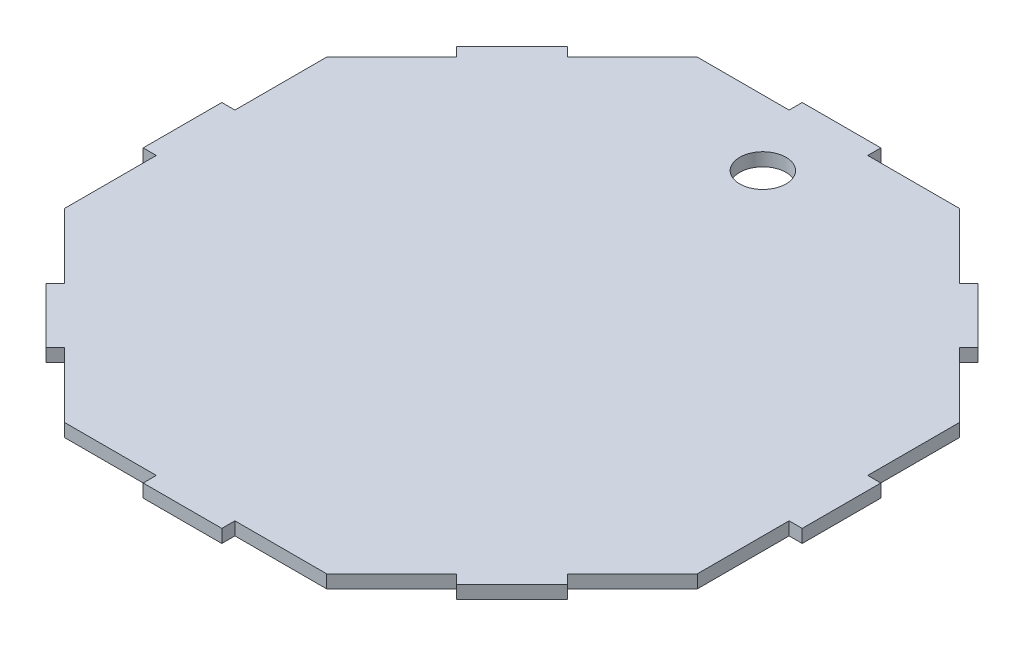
ISO-10303-21;
HEADER;
FILE_DESCRIPTION(('STEP AP214'),'2;1');
FILE_NAME('part.step','',(''),(''),'','','');
FILE_SCHEMA(('AUTOMOTIVE_DESIGN { 1 0 10303 214 1 1 1 1 }'));
ENDSEC;
DATA;
#1=APPLICATION_CONTEXT('core data for automotive mechanical design processes');
#2=APPLICATION_PROTOCOL_DEFINITION('international standard','automotive_design',2000,#1);
#3=PRODUCT_CONTEXT('',#1,'mechanical');
#4=PRODUCT('Part','Part','',(#3));
#5=PRODUCT_RELATED_PRODUCT_CATEGORY('part','',(#4));
#6=PRODUCT_DEFINITION_FORMATION('','',#4);
#7=PRODUCT_DEFINITION_CONTEXT('part definition',#1,'design');
#8=PRODUCT_DEFINITION('design','',#6,#7);
#9=PRODUCT_DEFINITION_SHAPE('','',#8);
#10=(LENGTH_UNIT() NAMED_UNIT(*) SI_UNIT(.MILLI.,.METRE.));
#11=(NAMED_UNIT(*) PLANE_ANGLE_UNIT() SI_UNIT($,.RADIAN.));
#12=(NAMED_UNIT(*) SI_UNIT($,.STERADIAN.) SOLID_ANGLE_UNIT());
#13=UNCERTAINTY_MEASURE_WITH_UNIT(LENGTH_MEASURE(1.E-05),#10,'distance_accuracy_value','');
#14=(GEOMETRIC_REPRESENTATION_CONTEXT(3) GLOBAL_UNCERTAINTY_ASSIGNED_CONTEXT((#13)) GLOBAL_UNIT_ASSIGNED_CONTEXT((#10,
#11,#12)) REPRESENTATION_CONTEXT('',''));
#15=CARTESIAN_POINT('',(0.,0.,0.));
#16=DIRECTION('',(0.,0.,1.));
#17=DIRECTION('',(1.,0.,0.));
#18=AXIS2_PLACEMENT_3D('',#15,#16,#17);
#19=CARTESIAN_POINT('',(104.801696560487,5.,8.72649424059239E-13));
#20=DIRECTION('',(1.,0.,0.));
#21=DIRECTION('',(0.,0.,-1.));
#22=AXIS2_PLACEMENT_3D('',#19,#20,#21);
#23=PLANE('',#22);
#24=DIRECTION('',(0.,0.,1.));
#25=VECTOR('',#24,1.);
#26=CARTESIAN_POINT('',(104.801696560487,0.,8.72649424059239E-13));
#27=LINE('',#26,#25);
#28=CARTESIAN_POINT('',(104.801696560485,0.,156.372402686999));
#29=VERTEX_POINT('',#28);
#30=CARTESIAN_POINT('',(104.801696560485,0.,161.372402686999));
#31=VERTEX_POINT('',#30);
#32=EDGE_CURVE('E326',#29,#31,#27,.T.);
#33=ORIENTED_EDGE('',*,*,#32,.F.);
#34=DIRECTION('',(0.,-1.,0.));
#35=VECTOR('',#34,1.);
#36=CARTESIAN_POINT('',(104.801696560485,5.,156.372402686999));
#37=LINE('',#36,#35);
#38=CARTESIAN_POINT('',(104.801696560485,5.,156.372402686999));
#39=VERTEX_POINT('',#38);
#40=EDGE_CURVE('E11',#39,#29,#37,.T.);
#41=ORIENTED_EDGE('',*,*,#40,.F.);
#42=DIRECTION('',(0.,0.,1.));
#43=VECTOR('',#42,1.);
#44=CARTESIAN_POINT('',(104.801696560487,5.,8.72649424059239E-13));
#45=LINE('',#44,#43);
#46=CARTESIAN_POINT('',(104.801696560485,5.,161.372402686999));
#47=VERTEX_POINT('',#46);
#48=EDGE_CURVE('E540',#39,#47,#45,.T.);
#49=ORIENTED_EDGE('',*,*,#48,.T.);
#50=DIRECTION('',(0.,-1.,0.));
#51=VECTOR('',#50,1.);
#52=CARTESIAN_POINT('',(104.801696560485,5.,161.372402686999));
#53=LINE('',#52,#51);
#54=EDGE_CURVE('E54',#47,#31,#53,.T.);
#55=ORIENTED_EDGE('',*,*,#54,.T.);
#56=EDGE_LOOP('',(#33,#41,#49,#55));
#57=FACE_BOUND('',#56,.T.);
#58=ADVANCED_FACE('F37',(#57),#23,.T.);
#59=CARTESIAN_POINT('',(7.44035322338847E-13,5.,156.372402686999));
#60=DIRECTION('',(0.,0.,1.));
#61=DIRECTION('',(1.,0.,0.));
#62=AXIS2_PLACEMENT_3D('',#59,#60,#61);
#63=PLANE('',#62);
#64=DIRECTION('',(-1.,0.,0.));
#65=VECTOR('',#64,1.);
#66=CARTESIAN_POINT('',(7.44035322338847E-13,0.,156.372402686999));
#67=LINE('',#66,#65);
#68=CARTESIAN_POINT('',(139.801696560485,0.,156.372402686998));
#69=VERTEX_POINT('',#68);
#70=EDGE_CURVE('E328',#69,#29,#67,.T.);
#71=ORIENTED_EDGE('',*,*,#70,.F.);
#72=DIRECTION('',(0.,-1.,0.));
#73=VECTOR('',#72,1.);
#74=CARTESIAN_POINT('',(139.801696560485,5.,156.372402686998));
#75=LINE('',#74,#73);
#76=CARTESIAN_POINT('',(139.801696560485,5.,156.372402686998));
#77=VERTEX_POINT('',#76);
#78=EDGE_CURVE('E46',#77,#69,#75,.T.);
#79=ORIENTED_EDGE('',*,*,#78,.F.);
#80=DIRECTION('',(-1.,0.,0.));
#81=VECTOR('',#80,1.);
#82=CARTESIAN_POINT('',(7.44035322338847E-13,5.,156.372402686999));
#83=LINE('',#82,#81);
#84=EDGE_CURVE('E538',#77,#39,#83,.T.);
#85=ORIENTED_EDGE('',*,*,#84,.T.);
#86=ORIENTED_EDGE('',*,*,#40,.T.);
#87=EDGE_LOOP('',(#71,#79,#85,#86));
#88=FACE_BOUND('',#87,.T.);
#89=ADVANCED_FACE('F523',(#88),#63,.T.);
#90=CARTESIAN_POINT('',(148.087049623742,5.,148.087049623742));
#91=DIRECTION('',(0.707106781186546,0.,0.707106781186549));
#92=DIRECTION('',(0.707106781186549,0.,-0.707106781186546));
#93=AXIS2_PLACEMENT_3D('',#90,#91,#92);
#94=PLANE('',#93);
#95=DIRECTION('',(-0.707106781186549,0.,0.707106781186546));
#96=VECTOR('',#95,1.);
#97=CARTESIAN_POINT('',(148.087049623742,0.,148.087049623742));
#98=LINE('',#97,#96);
#99=CARTESIAN_POINT('',(164.550433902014,0.,131.623665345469));
#100=VERTEX_POINT('',#99);
#101=EDGE_CURVE('E331',#100,#69,#98,.T.);
#102=ORIENTED_EDGE('',*,*,#101,.F.);
#103=DIRECTION('',(0.,-1.,0.));
#104=VECTOR('',#103,1.);
#105=CARTESIAN_POINT('',(164.550433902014,5.,131.623665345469));
#106=LINE('',#105,#104);
#107=CARTESIAN_POINT('',(164.550433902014,5.,131.623665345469));
#108=VERTEX_POINT('',#107);
#109=EDGE_CURVE('E512',#108,#100,#106,.T.);
#110=ORIENTED_EDGE('',*,*,#109,.F.);
#111=DIRECTION('',(-0.707106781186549,0.,0.707106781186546));
#112=VECTOR('',#111,1.);
#113=CARTESIAN_POINT('',(148.087049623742,5.,148.087049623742));
#114=LINE('',#113,#112);
#115=EDGE_CURVE('E519',#108,#77,#114,.T.);
#116=ORIENTED_EDGE('',*,*,#115,.T.);
#117=ORIENTED_EDGE('',*,*,#78,.T.);
#118=EDGE_LOOP('',(#102,#110,#116,#117));
#119=FACE_BOUND('',#118,.T.);
#120=ADVANCED_FACE('F517',(#119),#94,.T.);
#121=CARTESIAN_POINT('',(16.4633842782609,5.,-16.4633842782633));
#122=DIRECTION('',(0.707106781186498,0.,-0.707106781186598));
#123=DIRECTION('',(-0.707106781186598,0.,-0.707106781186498));
#124=AXIS2_PLACEMENT_3D('',#121,#122,#123);
#125=PLANE('',#124);
#126=DIRECTION('',(0.707106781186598,0.,0.707106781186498));
#127=VECTOR('',#126,1.);
#128=CARTESIAN_POINT('',(16.4633842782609,0.,-16.4633842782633));
#129=LINE('',#128,#127);
#130=CARTESIAN_POINT('',(168.085967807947,0.,135.159199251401));
#131=VERTEX_POINT('',#130);
#132=EDGE_CURVE('E334',#100,#131,#129,.T.);
#133=ORIENTED_EDGE('',*,*,#132,.T.);
#134=DIRECTION('',(0.,-1.,0.));
#135=VECTOR('',#134,1.);
#136=CARTESIAN_POINT('',(168.085967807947,5.,135.159199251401));
#137=LINE('',#136,#135);
#138=CARTESIAN_POINT('',(168.085967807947,5.,135.159199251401));
#139=VERTEX_POINT('',#138);
#140=EDGE_CURVE('E510',#139,#131,#137,.T.);
#141=ORIENTED_EDGE('',*,*,#140,.F.);
#142=DIRECTION('',(0.707106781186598,0.,0.707106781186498));
#143=VECTOR('',#142,1.);
#144=CARTESIAN_POINT('',(16.4633842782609,5.,-16.4633842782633));
#145=LINE('',#144,#143);
#146=EDGE_CURVE('E534',#108,#139,#145,.T.);
#147=ORIENTED_EDGE('',*,*,#146,.F.);
#148=ORIENTED_EDGE('',*,*,#109,.T.);
#149=EDGE_LOOP('',(#133,#141,#147,#148));
#150=FACE_BOUND('',#149,.T.);
#151=ADVANCED_FACE('F531',(#150),#125,.F.);
#152=CARTESIAN_POINT('',(151.622583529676,5.,151.622583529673));
#153=DIRECTION('',(0.707106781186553,0.,0.707106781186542));
#154=DIRECTION('',(0.707106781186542,0.,-0.707106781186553));
#155=AXIS2_PLACEMENT_3D('',#152,#153,#154);
#156=PLANE('',#155);
#157=DIRECTION('',(-0.707106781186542,0.,0.707106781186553));
#158=VECTOR('',#157,1.);
#159=CARTESIAN_POINT('',(151.622583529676,0.,151.622583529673));
#160=LINE('',#159,#158);
#161=CARTESIAN_POINT('',(189.299171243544,0.,113.945995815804));
#162=VERTEX_POINT('',#161);
#163=EDGE_CURVE('E337',#162,#131,#160,.T.);
#164=ORIENTED_EDGE('',*,*,#163,.F.);
#165=DIRECTION('',(0.,-1.,0.));
#166=VECTOR('',#165,1.);
#167=CARTESIAN_POINT('',(189.299171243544,5.,113.945995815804));
#168=LINE('',#167,#166);
#169=CARTESIAN_POINT('',(189.299171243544,5.,113.945995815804));
#170=VERTEX_POINT('',#169);
#171=EDGE_CURVE('E508',#170,#162,#168,.T.);
#172=ORIENTED_EDGE('',*,*,#171,.F.);
#173=DIRECTION('',(-0.707106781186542,0.,0.707106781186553));
#174=VECTOR('',#173,1.);
#175=CARTESIAN_POINT('',(151.622583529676,5.,151.622583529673));
#176=LINE('',#175,#174);
#177=EDGE_CURVE('E536',#170,#139,#176,.T.);
#178=ORIENTED_EDGE('',*,*,#177,.T.);
#179=ORIENTED_EDGE('',*,*,#140,.T.);
#180=EDGE_LOOP('',(#164,#172,#178,#179));
#181=FACE_BOUND('',#180,.T.);
#182=ADVANCED_FACE('F656',(#181),#156,.T.);
#183=CARTESIAN_POINT('',(37.676587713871,5.,-37.6765877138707));
#184=DIRECTION('',(-0.70710678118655,0.,0.707106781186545));
#185=DIRECTION('',(0.707106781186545,0.,0.70710678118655));
#186=AXIS2_PLACEMENT_3D('',#183,#184,#185);
#187=PLANE('',#186);
#188=DIRECTION('',(-0.707106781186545,0.,-0.70710678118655));
#189=VECTOR('',#188,1.);
#190=CARTESIAN_POINT('',(37.676587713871,0.,-37.6765877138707));
#191=LINE('',#190,#189);
#192=CARTESIAN_POINT('',(185.763637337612,0.,110.410461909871));
#193=VERTEX_POINT('',#192);
#194=EDGE_CURVE('E340',#162,#193,#191,.T.);
#195=ORIENTED_EDGE('',*,*,#194,.T.);
#196=DIRECTION('',(0.,-1.,0.));
#197=VECTOR('',#196,1.);
#198=CARTESIAN_POINT('',(185.763637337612,5.,110.410461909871));
#199=LINE('',#198,#197);
#200=CARTESIAN_POINT('',(185.763637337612,5.,110.410461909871));
#201=VERTEX_POINT('',#200);
#202=EDGE_CURVE('E506',#201,#193,#199,.T.);
#203=ORIENTED_EDGE('',*,*,#202,.F.);
#204=DIRECTION('',(-0.707106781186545,0.,-0.70710678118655));
#205=VECTOR('',#204,1.);
#206=CARTESIAN_POINT('',(37.676587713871,5.,-37.6765877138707));
#207=LINE('',#206,#205);
#208=EDGE_CURVE('E545',#170,#201,#207,.T.);
#209=ORIENTED_EDGE('',*,*,#208,.F.);
#210=ORIENTED_EDGE('',*,*,#171,.T.);
#211=EDGE_LOOP('',(#195,#203,#209,#210));
#212=FACE_BOUND('',#211,.T.);
#213=ADVANCED_FACE('F659',(#212),#187,.F.);
#214=CARTESIAN_POINT('',(148.087049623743,5.,148.087049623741));
#215=DIRECTION('',(0.707106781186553,0.,0.707106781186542));
#216=DIRECTION('',(0.707106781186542,0.,-0.707106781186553));
#217=AXIS2_PLACEMENT_3D('',#214,#215,#216);
#218=PLANE('',#217);
#219=DIRECTION('',(-0.707106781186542,0.,0.707106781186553));
#220=VECTOR('',#219,1.);
#221=CARTESIAN_POINT('',(148.087049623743,0.,148.087049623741));
#222=LINE('',#221,#220);
#223=CARTESIAN_POINT('',(210.51237467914,0.,85.6617245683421));
#224=VERTEX_POINT('',#223);
#225=EDGE_CURVE('E343',#224,#193,#222,.T.);
#226=ORIENTED_EDGE('',*,*,#225,.F.);
#227=DIRECTION('',(0.,-1.,0.));
#228=VECTOR('',#227,1.);
#229=CARTESIAN_POINT('',(210.51237467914,5.,85.6617245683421));
#230=LINE('',#229,#228);
#231=CARTESIAN_POINT('',(210.51237467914,5.,85.6617245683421));
#232=VERTEX_POINT('',#231);
#233=EDGE_CURVE('E504',#232,#224,#230,.T.);
#234=ORIENTED_EDGE('',*,*,#233,.F.);
#235=DIRECTION('',(-0.707106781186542,0.,0.707106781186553));
#236=VECTOR('',#235,1.);
#237=CARTESIAN_POINT('',(148.087049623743,5.,148.087049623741));
#238=LINE('',#237,#236);
#239=EDGE_CURVE('E547',#232,#201,#238,.T.);
#240=ORIENTED_EDGE('',*,*,#239,.T.);
#241=ORIENTED_EDGE('',*,*,#202,.T.);
#242=EDGE_LOOP('',(#226,#234,#240,#241));
#243=FACE_BOUND('',#242,.T.);
#244=ADVANCED_FACE('F663',(#243),#218,.T.);
#245=CARTESIAN_POINT('',(210.512374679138,5.,-7.01147056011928E-12));
#246=DIRECTION('',(1.,0.,0.));
#247=DIRECTION('',(0.,0.,-1.));
#248=AXIS2_PLACEMENT_3D('',#245,#246,#247);
#249=PLANE('',#248);
#250=DIRECTION('',(0.,0.,1.));
#251=VECTOR('',#250,1.);
#252=CARTESIAN_POINT('',(210.512374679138,0.,-7.01147056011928E-12));
#253=LINE('',#252,#251);
#254=CARTESIAN_POINT('',(210.512374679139,0.,50.661724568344));
#255=VERTEX_POINT('',#254);
#256=EDGE_CURVE('E346',#255,#224,#253,.T.);
#257=ORIENTED_EDGE('',*,*,#256,.F.);
#258=DIRECTION('',(0.,-1.,0.));
#259=VECTOR('',#258,1.);
#260=CARTESIAN_POINT('',(210.512374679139,5.,50.661724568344));
#261=LINE('',#260,#259);
#262=CARTESIAN_POINT('',(210.512374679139,5.,50.661724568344));
#263=VERTEX_POINT('',#262);
#264=EDGE_CURVE('E502',#263,#255,#261,.T.);
#265=ORIENTED_EDGE('',*,*,#264,.F.);
#266=DIRECTION('',(0.,0.,1.));
#267=VECTOR('',#266,1.);
#268=CARTESIAN_POINT('',(210.512374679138,5.,-7.01147056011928E-12));
#269=LINE('',#268,#267);
#270=EDGE_CURVE('E550',#263,#232,#269,.T.);
#271=ORIENTED_EDGE('',*,*,#270,.T.);
#272=ORIENTED_EDGE('',*,*,#233,.T.);
#273=EDGE_LOOP('',(#257,#265,#271,#272));
#274=FACE_BOUND('',#273,.T.);
#275=ADVANCED_FACE('F667',(#274),#249,.T.);
#276=CARTESIAN_POINT('',(2.10921799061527E-11,5.,50.6617245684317));
#277=DIRECTION('',(-4.16333634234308E-13,0.,-1.));
#278=DIRECTION('',(-1.,0.,4.16333634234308E-13));
#279=AXIS2_PLACEMENT_3D('',#276,#277,#278);
#280=PLANE('',#279);
#281=DIRECTION('',(1.,0.,-4.16333634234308E-13));
#282=VECTOR('',#281,1.);
#283=CARTESIAN_POINT('',(2.10921799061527E-11,0.,50.6617245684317));
#284=LINE('',#283,#282);
#285=CARTESIAN_POINT('',(215.512374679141,0.,50.6617245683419));
#286=VERTEX_POINT('',#285);
#287=EDGE_CURVE('E349',#255,#286,#284,.T.);
#288=ORIENTED_EDGE('',*,*,#287,.T.);
#289=DIRECTION('',(0.,-1.,0.));
#290=VECTOR('',#289,1.);
#291=CARTESIAN_POINT('',(215.512374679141,5.,50.6617245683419));
#292=LINE('',#291,#290);
#293=CARTESIAN_POINT('',(215.512374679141,5.,50.6617245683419));
#294=VERTEX_POINT('',#293);
#295=EDGE_CURVE('E500',#294,#286,#292,.T.);
#296=ORIENTED_EDGE('',*,*,#295,.F.);
#297=DIRECTION('',(1.,0.,-4.16333634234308E-13));
#298=VECTOR('',#297,1.);
#299=CARTESIAN_POINT('',(2.10921799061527E-11,5.,50.6617245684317));
#300=LINE('',#299,#298);
#301=EDGE_CURVE('E553',#263,#294,#300,.T.);
#302=ORIENTED_EDGE('',*,*,#301,.F.);
#303=ORIENTED_EDGE('',*,*,#264,.T.);
#304=EDGE_LOOP('',(#288,#296,#302,#303));
#305=FACE_BOUND('',#304,.T.);
#306=ADVANCED_FACE('F671',(#305),#280,.F.);
#307=CARTESIAN_POINT('',(215.512374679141,5.,2.19327900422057E-12));
#308=DIRECTION('',(1.,0.,0.));
#309=DIRECTION('',(0.,0.,-1.));
#310=AXIS2_PLACEMENT_3D('',#307,#308,#309);
#311=PLANE('',#310);
#312=DIRECTION('',(0.,0.,1.));
#313=VECTOR('',#312,1.);
#314=CARTESIAN_POINT('',(215.512374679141,0.,2.19327900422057E-12));
#315=LINE('',#314,#313);
#316=CARTESIAN_POINT('',(215.512374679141,0.,20.6617245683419));
#317=VERTEX_POINT('',#316);
#318=EDGE_CURVE('E352',#317,#286,#315,.T.);
#319=ORIENTED_EDGE('',*,*,#318,.F.);
#320=DIRECTION('',(0.,-1.,0.));
#321=VECTOR('',#320,1.);
#322=CARTESIAN_POINT('',(215.512374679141,5.,20.6617245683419));
#323=LINE('',#322,#321);
#324=CARTESIAN_POINT('',(215.512374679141,5.,20.6617245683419));
#325=VERTEX_POINT('',#324);
#326=EDGE_CURVE('E498',#325,#317,#323,.T.);
#327=ORIENTED_EDGE('',*,*,#326,.F.);
#328=DIRECTION('',(0.,0.,1.));
#329=VECTOR('',#328,1.);
#330=CARTESIAN_POINT('',(215.512374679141,5.,2.19327900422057E-12));
#331=LINE('',#330,#329);
#332=EDGE_CURVE('E555',#325,#294,#331,.T.);
#333=ORIENTED_EDGE('',*,*,#332,.T.);
#334=ORIENTED_EDGE('',*,*,#295,.T.);
#335=EDGE_LOOP('',(#319,#327,#333,#334));
#336=FACE_BOUND('',#335,.T.);
#337=ADVANCED_FACE('F675',(#336),#311,.T.);
#338=CARTESIAN_POINT('',(0.,5.,20.6617245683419));
#339=DIRECTION('',(0.,0.,-1.));
#340=DIRECTION('',(-1.,0.,0.));
#341=AXIS2_PLACEMENT_3D('',#338,#339,#340);
#342=PLANE('',#341);
#343=DIRECTION('',(1.,0.,0.));
#344=VECTOR('',#343,1.);
#345=CARTESIAN_POINT('',(0.,0.,20.6617245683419));
#346=LINE('',#345,#344);
#347=CARTESIAN_POINT('',(210.512374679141,0.,20.6617245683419));
#348=VERTEX_POINT('',#347);
#349=EDGE_CURVE('E355',#348,#317,#346,.T.);
#350=ORIENTED_EDGE('',*,*,#349,.F.);
#351=DIRECTION('',(0.,-1.,0.));
#352=VECTOR('',#351,1.);
#353=CARTESIAN_POINT('',(210.512374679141,5.,20.6617245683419));
#354=LINE('',#353,#352);
#355=CARTESIAN_POINT('',(210.512374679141,5.,20.6617245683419));
#356=VERTEX_POINT('',#355);
#357=EDGE_CURVE('E496',#356,#348,#354,.T.);
#358=ORIENTED_EDGE('',*,*,#357,.F.);
#359=DIRECTION('',(1.,0.,0.));
#360=VECTOR('',#359,1.);
#361=CARTESIAN_POINT('',(0.,5.,20.6617245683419));
#362=LINE('',#361,#360);
#363=EDGE_CURVE('E558',#356,#325,#362,.T.);
#364=ORIENTED_EDGE('',*,*,#363,.T.);
#365=ORIENTED_EDGE('',*,*,#326,.T.);
#366=EDGE_LOOP('',(#350,#358,#364,#365));
#367=FACE_BOUND('',#366,.T.);
#368=ADVANCED_FACE('F679',(#367),#342,.T.);
#369=CARTESIAN_POINT('',(210.512374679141,5.,2.00327730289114E-12));
#370=DIRECTION('',(1.,0.,0.));
#371=DIRECTION('',(0.,0.,-1.));
#372=AXIS2_PLACEMENT_3D('',#369,#370,#371);
#373=PLANE('',#372);
#374=DIRECTION('',(0.,0.,1.));
#375=VECTOR('',#374,1.);
#376=CARTESIAN_POINT('',(210.512374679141,0.,2.00327730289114E-12));
#377=LINE('',#376,#375);
#378=CARTESIAN_POINT('',(210.512374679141,0.,-14.3382754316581));
#379=VERTEX_POINT('',#378);
#380=EDGE_CURVE('E358',#379,#348,#377,.T.);
#381=ORIENTED_EDGE('',*,*,#380,.F.);
#382=DIRECTION('',(0.,-1.,0.));
#383=VECTOR('',#382,1.);
#384=CARTESIAN_POINT('',(210.512374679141,5.,-14.3382754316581));
#385=LINE('',#384,#383);
#386=CARTESIAN_POINT('',(210.512374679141,5.,-14.3382754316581));
#387=VERTEX_POINT('',#386);
#388=EDGE_CURVE('E494',#387,#379,#385,.T.);
#389=ORIENTED_EDGE('',*,*,#388,.F.);
#390=DIRECTION('',(0.,0.,1.));
#391=VECTOR('',#390,1.);
#392=CARTESIAN_POINT('',(210.512374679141,5.,2.00327730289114E-12));
#393=LINE('',#392,#391);
#394=EDGE_CURVE('E561',#387,#356,#393,.T.);
#395=ORIENTED_EDGE('',*,*,#394,.T.);
#396=ORIENTED_EDGE('',*,*,#357,.T.);
#397=EDGE_LOOP('',(#381,#389,#395,#396));
#398=FACE_BOUND('',#397,.T.);
#399=ADVANCED_FACE('F683',(#398),#373,.T.);
#400=CARTESIAN_POINT('',(112.425325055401,5.,-112.4253250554));
#401=DIRECTION('',(0.707106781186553,0.,-0.707106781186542));
#402=DIRECTION('',(-0.707106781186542,0.,-0.707106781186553));
#403=AXIS2_PLACEMENT_3D('',#400,#401,#402);
#404=PLANE('',#403);
#405=DIRECTION('',(0.707106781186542,0.,0.707106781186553));
#406=VECTOR('',#405,1.);
#407=CARTESIAN_POINT('',(112.425325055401,0.,-112.4253250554));
#408=LINE('',#407,#406);
#409=CARTESIAN_POINT('',(185.763637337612,0.,-39.0870127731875));
#410=VERTEX_POINT('',#409);
#411=EDGE_CURVE('E361',#410,#379,#408,.T.);
#412=ORIENTED_EDGE('',*,*,#411,.F.);
#413=DIRECTION('',(0.,-1.,0.));
#414=VECTOR('',#413,1.);
#415=CARTESIAN_POINT('',(185.763637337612,5.,-39.0870127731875));
#416=LINE('',#415,#414);
#417=CARTESIAN_POINT('',(185.763637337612,5.,-39.0870127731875));
#418=VERTEX_POINT('',#417);
#419=EDGE_CURVE('E492',#418,#410,#416,.T.);
#420=ORIENTED_EDGE('',*,*,#419,.F.);
#421=DIRECTION('',(0.707106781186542,0.,0.707106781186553));
#422=VECTOR('',#421,1.);
#423=CARTESIAN_POINT('',(112.425325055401,5.,-112.4253250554));
#424=LINE('',#423,#422);
#425=EDGE_CURVE('E564',#418,#387,#424,.T.);
#426=ORIENTED_EDGE('',*,*,#425,.T.);
#427=ORIENTED_EDGE('',*,*,#388,.T.);
#428=EDGE_LOOP('',(#412,#420,#426,#427));
#429=FACE_BOUND('',#428,.T.);
#430=ADVANCED_FACE('F687',(#429),#404,.T.);
#431=CARTESIAN_POINT('',(73.3383122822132,5.,73.3383122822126));
#432=DIRECTION('',(0.70710678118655,0.,0.707106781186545));
#433=DIRECTION('',(0.707106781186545,0.,-0.70710678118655));
#434=AXIS2_PLACEMENT_3D('',#431,#432,#433);
#435=PLANE('',#434);
#436=DIRECTION('',(-0.707106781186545,0.,0.70710678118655));
#437=VECTOR('',#436,1.);
#438=CARTESIAN_POINT('',(73.3383122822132,0.,73.3383122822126));
#439=LINE('',#438,#437);
#440=CARTESIAN_POINT('',(189.299171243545,0.,-42.6225466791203));
#441=VERTEX_POINT('',#440);
#442=EDGE_CURVE('E364',#441,#410,#439,.T.);
#443=ORIENTED_EDGE('',*,*,#442,.F.);
#444=DIRECTION('',(0.,-1.,0.));
#445=VECTOR('',#444,1.);
#446=CARTESIAN_POINT('',(189.299171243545,5.,-42.6225466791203));
#447=LINE('',#446,#445);
#448=CARTESIAN_POINT('',(189.299171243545,5.,-42.6225466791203));
#449=VERTEX_POINT('',#448);
#450=EDGE_CURVE('E490',#449,#441,#447,.T.);
#451=ORIENTED_EDGE('',*,*,#450,.F.);
#452=DIRECTION('',(-0.707106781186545,0.,0.70710678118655));
#453=VECTOR('',#452,1.);
#454=CARTESIAN_POINT('',(73.3383122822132,5.,73.3383122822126));
#455=LINE('',#454,#453);
#456=EDGE_CURVE('E567',#449,#418,#455,.T.);
#457=ORIENTED_EDGE('',*,*,#456,.T.);
#458=ORIENTED_EDGE('',*,*,#419,.T.);
#459=EDGE_LOOP('',(#443,#451,#457,#458));
#460=FACE_BOUND('',#459,.T.);
#461=ADVANCED_FACE('F691',(#460),#435,.T.);
#462=CARTESIAN_POINT('',(115.960858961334,5.,-115.960858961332));
#463=DIRECTION('',(0.707106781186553,0.,-0.707106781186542));
#464=DIRECTION('',(-0.707106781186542,0.,-0.707106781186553));
#465=AXIS2_PLACEMENT_3D('',#462,#463,#464);
#466=PLANE('',#465);
#467=DIRECTION('',(0.707106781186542,0.,0.707106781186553));
#468=VECTOR('',#467,1.);
#469=CARTESIAN_POINT('',(115.960858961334,0.,-115.960858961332));
#470=LINE('',#469,#468);
#471=CARTESIAN_POINT('',(168.085967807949,0.,-63.8357501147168));
#472=VERTEX_POINT('',#471);
#473=EDGE_CURVE('E367',#472,#441,#470,.T.);
#474=ORIENTED_EDGE('',*,*,#473,.F.);
#475=DIRECTION('',(0.,-1.,0.));
#476=VECTOR('',#475,1.);
#477=CARTESIAN_POINT('',(168.085967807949,5.,-63.8357501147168));
#478=LINE('',#477,#476);
#479=CARTESIAN_POINT('',(168.085967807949,5.,-63.8357501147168));
#480=VERTEX_POINT('',#479);
#481=EDGE_CURVE('E488',#480,#472,#478,.T.);
#482=ORIENTED_EDGE('',*,*,#481,.F.);
#483=DIRECTION('',(0.707106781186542,0.,0.707106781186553));
#484=VECTOR('',#483,1.);
#485=CARTESIAN_POINT('',(115.960858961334,5.,-115.960858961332));
#486=LINE('',#485,#484);
#487=EDGE_CURVE('E570',#480,#449,#486,.T.);
#488=ORIENTED_EDGE('',*,*,#487,.T.);
#489=ORIENTED_EDGE('',*,*,#450,.T.);
#490=EDGE_LOOP('',(#474,#482,#488,#489));
#491=FACE_BOUND('',#490,.T.);
#492=ADVANCED_FACE('F695',(#491),#466,.T.);
#493=CARTESIAN_POINT('',(52.125108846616,5.,52.125108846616));
#494=DIRECTION('',(0.707106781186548,0.,0.707106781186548));
#495=DIRECTION('',(0.707106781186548,0.,-0.707106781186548));
#496=AXIS2_PLACEMENT_3D('',#493,#494,#495);
#497=PLANE('',#496);
#498=DIRECTION('',(-0.707106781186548,0.,0.707106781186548));
#499=VECTOR('',#498,1.);
#500=CARTESIAN_POINT('',(52.125108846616,0.,52.125108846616));
#501=LINE('',#500,#499);
#502=CARTESIAN_POINT('',(164.550433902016,0.,-60.3002162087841));
#503=VERTEX_POINT('',#502);
#504=EDGE_CURVE('E370',#472,#503,#501,.T.);
#505=ORIENTED_EDGE('',*,*,#504,.T.);
#506=DIRECTION('',(0.,-1.,0.));
#507=VECTOR('',#506,1.);
#508=CARTESIAN_POINT('',(164.550433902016,5.,-60.3002162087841));
#509=LINE('',#508,#507);
#510=CARTESIAN_POINT('',(164.550433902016,5.,-60.3002162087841));
#511=VERTEX_POINT('',#510);
#512=EDGE_CURVE('E486',#511,#503,#509,.T.);
#513=ORIENTED_EDGE('',*,*,#512,.F.);
#514=DIRECTION('',(-0.707106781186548,0.,0.707106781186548));
#515=VECTOR('',#514,1.);
#516=CARTESIAN_POINT('',(52.125108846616,5.,52.125108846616));
#517=LINE('',#516,#515);
#518=EDGE_CURVE('E573',#480,#511,#517,.T.);
#519=ORIENTED_EDGE('',*,*,#518,.F.);
#520=ORIENTED_EDGE('',*,*,#481,.T.);
#521=EDGE_LOOP('',(#505,#513,#519,#520));
#522=FACE_BOUND('',#521,.T.);
#523=ADVANCED_FACE('F699',(#522),#497,.F.);
#524=CARTESIAN_POINT('',(112.425325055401,5.,-112.4253250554));
#525=DIRECTION('',(0.707106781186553,0.,-0.707106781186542));
#526=DIRECTION('',(-0.707106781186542,0.,-0.707106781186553));
#527=AXIS2_PLACEMENT_3D('',#524,#525,#526);
#528=PLANE('',#527);
#529=DIRECTION('',(0.707106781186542,0.,0.707106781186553));
#530=VECTOR('',#529,1.);
#531=CARTESIAN_POINT('',(112.425325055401,0.,-112.4253250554));
#532=LINE('',#531,#530);
#533=CARTESIAN_POINT('',(139.801696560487,0.,-85.0489535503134));
#534=VERTEX_POINT('',#533);
#535=EDGE_CURVE('E373',#534,#503,#532,.T.);
#536=ORIENTED_EDGE('',*,*,#535,.F.);
#537=DIRECTION('',(0.,-1.,0.));
#538=VECTOR('',#537,1.);
#539=CARTESIAN_POINT('',(139.801696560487,5.,-85.0489535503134));
#540=LINE('',#539,#538);
#541=CARTESIAN_POINT('',(139.801696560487,5.,-85.0489535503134));
#542=VERTEX_POINT('',#541);
#543=EDGE_CURVE('E484',#542,#534,#540,.T.);
#544=ORIENTED_EDGE('',*,*,#543,.F.);
#545=DIRECTION('',(0.707106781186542,0.,0.707106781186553));
#546=VECTOR('',#545,1.);
#547=CARTESIAN_POINT('',(112.425325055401,5.,-112.4253250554));
#548=LINE('',#547,#546);
#549=EDGE_CURVE('E575',#542,#511,#548,.T.);
#550=ORIENTED_EDGE('',*,*,#549,.T.);
#551=ORIENTED_EDGE('',*,*,#512,.T.);
#552=EDGE_LOOP('',(#536,#544,#550,#551));
#553=FACE_BOUND('',#552,.T.);
#554=ADVANCED_FACE('F703',(#553),#528,.T.);
#555=CARTESIAN_POINT('',(2.69780875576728E-13,5.,-85.0489535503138));
#556=DIRECTION('',(0.,0.,-1.));
#557=DIRECTION('',(-1.,0.,0.));
#558=AXIS2_PLACEMENT_3D('',#555,#556,#557);
#559=PLANE('',#558);
#560=DIRECTION('',(1.,0.,0.));
#561=VECTOR('',#560,1.);
#562=CARTESIAN_POINT('',(2.69780875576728E-13,0.,-85.0489535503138));
#563=LINE('',#562,#561);
#564=CARTESIAN_POINT('',(104.801696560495,0.,-85.0489535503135));
#565=VERTEX_POINT('',#564);
#566=EDGE_CURVE('E376',#565,#534,#563,.T.);
#567=ORIENTED_EDGE('',*,*,#566,.F.);
#568=DIRECTION('',(0.,-1.,0.));
#569=VECTOR('',#568,1.);
#570=CARTESIAN_POINT('',(104.801696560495,5.,-85.0489535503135));
#571=LINE('',#570,#569);
#572=CARTESIAN_POINT('',(104.801696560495,5.,-85.0489535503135));
#573=VERTEX_POINT('',#572);
#574=EDGE_CURVE('E482',#573,#565,#571,.T.);
#575=ORIENTED_EDGE('',*,*,#574,.F.);
#576=DIRECTION('',(1.,0.,0.));
#577=VECTOR('',#576,1.);
#578=CARTESIAN_POINT('',(2.69780875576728E-13,5.,-85.0489535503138));
#579=LINE('',#578,#577);
#580=EDGE_CURVE('E578',#573,#542,#579,.T.);
#581=ORIENTED_EDGE('',*,*,#580,.T.);
#582=ORIENTED_EDGE('',*,*,#543,.T.);
#583=EDGE_LOOP('',(#567,#575,#581,#582));
#584=FACE_BOUND('',#583,.T.);
#585=ADVANCED_FACE('F707',(#584),#559,.T.);
#586=CARTESIAN_POINT('',(104.801696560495,5.,0.));
#587=DIRECTION('',(1.,0.,0.));
#588=DIRECTION('',(0.,0.,-1.));
#589=AXIS2_PLACEMENT_3D('',#586,#587,#588);
#590=PLANE('',#589);
#591=DIRECTION('',(0.,0.,1.));
#592=VECTOR('',#591,1.);
#593=CARTESIAN_POINT('',(104.801696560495,0.,0.));
#594=LINE('',#593,#592);
#595=CARTESIAN_POINT('',(104.801696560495,0.,-90.0489535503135));
#596=VERTEX_POINT('',#595);
#597=EDGE_CURVE('E379',#596,#565,#594,.T.);
#598=ORIENTED_EDGE('',*,*,#597,.F.);
#599=DIRECTION('',(0.,-1.,0.));
#600=VECTOR('',#599,1.);
#601=CARTESIAN_POINT('',(104.801696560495,5.,-90.0489535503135));
#602=LINE('',#601,#600);
#603=CARTESIAN_POINT('',(104.801696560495,5.,-90.0489535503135));
#604=VERTEX_POINT('',#603);
#605=EDGE_CURVE('E480',#604,#596,#602,.T.);
#606=ORIENTED_EDGE('',*,*,#605,.F.);
#607=DIRECTION('',(0.,0.,1.));
#608=VECTOR('',#607,1.);
#609=CARTESIAN_POINT('',(104.801696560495,5.,0.));
#610=LINE('',#609,#608);
#611=EDGE_CURVE('E581',#604,#573,#610,.T.);
#612=ORIENTED_EDGE('',*,*,#611,.T.);
#613=ORIENTED_EDGE('',*,*,#574,.T.);
#614=EDGE_LOOP('',(#598,#606,#612,#613));
#615=FACE_BOUND('',#614,.T.);
#616=ADVANCED_FACE('F711',(#615),#590,.T.);
#617=CARTESIAN_POINT('',(7.91464170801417E-13,5.,-90.0489535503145));
#618=DIRECTION('',(0.,0.,-1.));
#619=DIRECTION('',(-1.,0.,0.));
#620=AXIS2_PLACEMENT_3D('',#617,#618,#619);
#621=PLANE('',#620);
#622=DIRECTION('',(1.,0.,0.));
#623=VECTOR('',#622,1.);
#624=CARTESIAN_POINT('',(7.91464170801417E-13,0.,-90.0489535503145));
#625=LINE('',#624,#623);
#626=CARTESIAN_POINT('',(74.8016965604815,0.,-90.0489535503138));
#627=VERTEX_POINT('',#626);
#628=EDGE_CURVE('E382',#627,#596,#625,.T.);
#629=ORIENTED_EDGE('',*,*,#628,.F.);
#630=DIRECTION('',(0.,-1.,0.));
#631=VECTOR('',#630,1.);
#632=CARTESIAN_POINT('',(74.8016965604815,5.,-90.0489535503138));
#633=LINE('',#632,#631);
#634=CARTESIAN_POINT('',(74.8016965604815,5.,-90.0489535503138));
#635=VERTEX_POINT('',#634);
#636=EDGE_CURVE('E478',#635,#627,#633,.T.);
#637=ORIENTED_EDGE('',*,*,#636,.F.);
#638=DIRECTION('',(1.,0.,0.));
#639=VECTOR('',#638,1.);
#640=CARTESIAN_POINT('',(7.91464170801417E-13,5.,-90.0489535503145));
#641=LINE('',#640,#639);
#642=EDGE_CURVE('E584',#635,#604,#641,.T.);
#643=ORIENTED_EDGE('',*,*,#642,.T.);
#644=ORIENTED_EDGE('',*,*,#605,.T.);
#645=EDGE_LOOP('',(#629,#637,#643,#644));
#646=FACE_BOUND('',#645,.T.);
#647=ADVANCED_FACE('F715',(#646),#621,.T.);
#648=CARTESIAN_POINT('',(74.8016965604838,5.,-1.86854773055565E-12));
#649=DIRECTION('',(-1.,0.,0.));
#650=DIRECTION('',(0.,0.,1.));
#651=AXIS2_PLACEMENT_3D('',#648,#649,#650);
#652=PLANE('',#651);
#653=DIRECTION('',(0.,0.,-1.));
#654=VECTOR('',#653,1.);
#655=CARTESIAN_POINT('',(74.8016965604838,0.,-1.86854773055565E-12));
#656=LINE('',#655,#654);
#657=CARTESIAN_POINT('',(74.8016965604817,0.,-85.0489535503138));
#658=VERTEX_POINT('',#657);
#659=EDGE_CURVE('E385',#658,#627,#656,.T.);
#660=ORIENTED_EDGE('',*,*,#659,.F.);
#661=DIRECTION('',(0.,-1.,0.));
#662=VECTOR('',#661,1.);
#663=CARTESIAN_POINT('',(74.8016965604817,5.,-85.0489535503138));
#664=LINE('',#663,#662);
#665=CARTESIAN_POINT('',(74.8016965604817,5.,-85.0489535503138));
#666=VERTEX_POINT('',#665);
#667=EDGE_CURVE('E476',#666,#658,#664,.T.);
#668=ORIENTED_EDGE('',*,*,#667,.F.);
#669=DIRECTION('',(0.,0.,-1.));
#670=VECTOR('',#669,1.);
#671=CARTESIAN_POINT('',(74.8016965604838,5.,-1.86854773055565E-12));
#672=LINE('',#671,#670);
#673=EDGE_CURVE('E587',#666,#635,#672,.T.);
#674=ORIENTED_EDGE('',*,*,#673,.T.);
#675=ORIENTED_EDGE('',*,*,#636,.T.);
#676=EDGE_LOOP('',(#660,#668,#674,#675));
#677=FACE_BOUND('',#676,.T.);
#678=ADVANCED_FACE('F719',(#677),#652,.T.);
#679=CARTESIAN_POINT('',(3.70948703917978E-13,5.,-85.0489535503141));
#680=DIRECTION('',(0.,0.,-1.));
#681=DIRECTION('',(-1.,0.,0.));
#682=AXIS2_PLACEMENT_3D('',#679,#680,#681);
#683=PLANE('',#682);
#684=DIRECTION('',(1.,0.,0.));
#685=VECTOR('',#684,1.);
#686=CARTESIAN_POINT('',(3.70948703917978E-13,0.,-85.0489535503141));
#687=LINE('',#686,#685);
#688=CARTESIAN_POINT('',(39.8016965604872,0.,-85.0489535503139));
#689=VERTEX_POINT('',#688);
#690=EDGE_CURVE('E388',#689,#658,#687,.T.);
#691=ORIENTED_EDGE('',*,*,#690,.F.);
#692=DIRECTION('',(0.,-1.,0.));
#693=VECTOR('',#692,1.);
#694=CARTESIAN_POINT('',(39.8016965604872,5.,-85.0489535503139));
#695=LINE('',#694,#693);
#696=CARTESIAN_POINT('',(39.8016965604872,5.,-85.0489535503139));
#697=VERTEX_POINT('',#696);
#698=EDGE_CURVE('E474',#697,#689,#695,.T.);
#699=ORIENTED_EDGE('',*,*,#698,.F.);
#700=DIRECTION('',(1.,0.,0.));
#701=VECTOR('',#700,1.);
#702=CARTESIAN_POINT('',(3.70948703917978E-13,5.,-85.0489535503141));
#703=LINE('',#702,#701);
#704=EDGE_CURVE('E590',#697,#666,#703,.T.);
#705=ORIENTED_EDGE('',*,*,#704,.T.);
#706=ORIENTED_EDGE('',*,*,#667,.T.);
#707=EDGE_LOOP('',(#691,#699,#705,#706));
#708=FACE_BOUND('',#707,.T.);
#709=ADVANCED_FACE('F723',(#708),#683,.T.);
#710=CARTESIAN_POINT('',(-22.6236284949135,5.,-22.6236284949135));
#711=DIRECTION('',(-0.707106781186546,0.,-0.707106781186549));
#712=DIRECTION('',(-0.707106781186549,0.,0.707106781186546));
#713=AXIS2_PLACEMENT_3D('',#710,#711,#712);
#714=PLANE('',#713);
#715=DIRECTION('',(0.707106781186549,0.,-0.707106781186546));
#716=VECTOR('',#715,1.);
#717=CARTESIAN_POINT('',(-22.6236284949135,0.,-22.6236284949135));
#718=LINE('',#717,#716);
#719=CARTESIAN_POINT('',(15.052959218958,0.,-60.3002162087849));
#720=VERTEX_POINT('',#719);
#721=EDGE_CURVE('E391',#720,#689,#718,.T.);
#722=ORIENTED_EDGE('',*,*,#721,.F.);
#723=DIRECTION('',(0.,-1.,0.));
#724=VECTOR('',#723,1.);
#725=CARTESIAN_POINT('',(15.052959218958,5.,-60.3002162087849));
#726=LINE('',#725,#724);
#727=CARTESIAN_POINT('',(15.052959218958,5.,-60.3002162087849));
#728=VERTEX_POINT('',#727);
#729=EDGE_CURVE('E472',#728,#720,#726,.T.);
#730=ORIENTED_EDGE('',*,*,#729,.F.);
#731=DIRECTION('',(0.707106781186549,0.,-0.707106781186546));
#732=VECTOR('',#731,1.);
#733=CARTESIAN_POINT('',(-22.6236284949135,5.,-22.6236284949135));
#734=LINE('',#733,#732);
#735=EDGE_CURVE('E593',#728,#697,#734,.T.);
#736=ORIENTED_EDGE('',*,*,#735,.T.);
#737=ORIENTED_EDGE('',*,*,#698,.T.);
#738=EDGE_LOOP('',(#722,#730,#736,#737));
#739=FACE_BOUND('',#738,.T.);
#740=ADVANCED_FACE('F727',(#739),#714,.T.);
#741=CARTESIAN_POINT('',(37.6765877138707,5.,-37.6765877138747));
#742=DIRECTION('',(-0.707106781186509,0.,0.707106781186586));
#743=DIRECTION('',(0.707106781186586,0.,0.707106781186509));
#744=AXIS2_PLACEMENT_3D('',#741,#742,#743);
#745=PLANE('',#744);
#746=DIRECTION('',(-0.707106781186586,0.,-0.707106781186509));
#747=VECTOR('',#746,1.);
#748=CARTESIAN_POINT('',(37.6765877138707,0.,-37.6765877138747));
#749=LINE('',#748,#747);
#750=CARTESIAN_POINT('',(11.5174253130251,0.,-63.8357501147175));
#751=VERTEX_POINT('',#750);
#752=EDGE_CURVE('E394',#720,#751,#749,.T.);
#753=ORIENTED_EDGE('',*,*,#752,.T.);
#754=DIRECTION('',(0.,-1.,0.));
#755=VECTOR('',#754,1.);
#756=CARTESIAN_POINT('',(11.5174253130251,5.,-63.8357501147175));
#757=LINE('',#756,#755);
#758=CARTESIAN_POINT('',(11.5174253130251,5.,-63.8357501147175));
#759=VERTEX_POINT('',#758);
#760=EDGE_CURVE('E470',#759,#751,#757,.T.);
#761=ORIENTED_EDGE('',*,*,#760,.F.);
#762=DIRECTION('',(-0.707106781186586,0.,-0.707106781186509));
#763=VECTOR('',#762,1.);
#764=CARTESIAN_POINT('',(37.6765877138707,5.,-37.6765877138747));
#765=LINE('',#764,#763);
#766=EDGE_CURVE('E596',#728,#759,#765,.T.);
#767=ORIENTED_EDGE('',*,*,#766,.F.);
#768=ORIENTED_EDGE('',*,*,#729,.T.);
#769=EDGE_LOOP('',(#753,#761,#767,#768));
#770=FACE_BOUND('',#769,.T.);
#771=ADVANCED_FACE('F731',(#770),#745,.F.);
#772=CARTESIAN_POINT('',(-26.1591624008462,5.,-26.1591624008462));
#773=DIRECTION('',(-0.707106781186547,0.,-0.707106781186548));
#774=DIRECTION('',(-0.707106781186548,0.,0.707106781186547));
#775=AXIS2_PLACEMENT_3D('',#772,#773,#774);
#776=PLANE('',#775);
#777=DIRECTION('',(0.707106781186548,0.,-0.707106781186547));
#778=VECTOR('',#777,1.);
#779=CARTESIAN_POINT('',(-26.1591624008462,0.,-26.1591624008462));
#780=LINE('',#779,#778);
#781=CARTESIAN_POINT('',(-9.69577812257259,0.,-42.6225466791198));
#782=VERTEX_POINT('',#781);
#783=EDGE_CURVE('E397',#782,#751,#780,.T.);
#784=ORIENTED_EDGE('',*,*,#783,.F.);
#785=DIRECTION('',(0.,-1.,0.));
#786=VECTOR('',#785,1.);
#787=CARTESIAN_POINT('',(-9.69577812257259,5.,-42.6225466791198));
#788=LINE('',#787,#786);
#789=CARTESIAN_POINT('',(-9.69577812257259,5.,-42.6225466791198));
#790=VERTEX_POINT('',#789);
#791=EDGE_CURVE('E468',#790,#782,#788,.T.);
#792=ORIENTED_EDGE('',*,*,#791,.F.);
#793=DIRECTION('',(0.707106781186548,0.,-0.707106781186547));
#794=VECTOR('',#793,1.);
#795=CARTESIAN_POINT('',(-26.1591624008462,5.,-26.1591624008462));
#796=LINE('',#795,#794);
#797=EDGE_CURVE('E598',#790,#759,#796,.T.);
#798=ORIENTED_EDGE('',*,*,#797,.T.);
#799=ORIENTED_EDGE('',*,*,#760,.T.);
#800=EDGE_LOOP('',(#784,#792,#798,#799));
#801=FACE_BOUND('',#800,.T.);
#802=ADVANCED_FACE('F735',(#801),#776,.T.);
#803=CARTESIAN_POINT('',(16.4633842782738,5.,-16.4633842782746));
#804=DIRECTION('',(0.707106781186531,0.,-0.707106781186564));
#805=DIRECTION('',(-0.707106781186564,0.,-0.707106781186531));
#806=AXIS2_PLACEMENT_3D('',#803,#804,#805);
#807=PLANE('',#806);
#808=DIRECTION('',(0.707106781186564,0.,0.707106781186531));
#809=VECTOR('',#808,1.);
#810=CARTESIAN_POINT('',(16.4633842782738,0.,-16.4633842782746));
#811=LINE('',#810,#809);
#812=CARTESIAN_POINT('',(-6.16024421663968,0.,-39.0870127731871));
#813=VERTEX_POINT('',#812);
#814=EDGE_CURVE('E400',#782,#813,#811,.T.);
#815=ORIENTED_EDGE('',*,*,#814,.T.);
#816=DIRECTION('',(0.,-1.,0.));
#817=VECTOR('',#816,1.);
#818=CARTESIAN_POINT('',(-6.16024421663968,5.,-39.0870127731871));
#819=LINE('',#818,#817);
#820=CARTESIAN_POINT('',(-6.16024421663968,5.,-39.0870127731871));
#821=VERTEX_POINT('',#820);
#822=EDGE_CURVE('E466',#821,#813,#819,.T.);
#823=ORIENTED_EDGE('',*,*,#822,.F.);
#824=DIRECTION('',(0.707106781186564,0.,0.707106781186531));
#825=VECTOR('',#824,1.);
#826=CARTESIAN_POINT('',(16.4633842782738,5.,-16.4633842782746));
#827=LINE('',#826,#825);
#828=EDGE_CURVE('E601',#790,#821,#827,.T.);
#829=ORIENTED_EDGE('',*,*,#828,.F.);
#830=ORIENTED_EDGE('',*,*,#791,.T.);
#831=EDGE_LOOP('',(#815,#823,#829,#830));
#832=FACE_BOUND('',#831,.T.);
#833=ADVANCED_FACE('F739',(#832),#807,.F.);
#834=CARTESIAN_POINT('',(-22.6236284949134,5.,-22.6236284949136));
#835=DIRECTION('',(-0.707106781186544,0.,-0.707106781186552));
#836=DIRECTION('',(-0.707106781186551,0.,0.707106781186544));
#837=AXIS2_PLACEMENT_3D('',#834,#835,#836);
#838=PLANE('',#837);
#839=DIRECTION('',(0.707106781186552,0.,-0.707106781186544));
#840=VECTOR('',#839,1.);
#841=CARTESIAN_POINT('',(-22.6236284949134,0.,-22.6236284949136));
#842=LINE('',#841,#840);
#843=CARTESIAN_POINT('',(-30.908981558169,0.,-14.3382754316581));
#844=VERTEX_POINT('',#843);
#845=EDGE_CURVE('E403',#844,#813,#842,.T.);
#846=ORIENTED_EDGE('',*,*,#845,.F.);
#847=DIRECTION('',(0.,-1.,0.));
#848=VECTOR('',#847,1.);
#849=CARTESIAN_POINT('',(-30.908981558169,5.,-14.3382754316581));
#850=LINE('',#849,#848);
#851=CARTESIAN_POINT('',(-30.908981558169,5.,-14.3382754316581));
#852=VERTEX_POINT('',#851);
#853=EDGE_CURVE('E464',#852,#844,#850,.T.);
#854=ORIENTED_EDGE('',*,*,#853,.F.);
#855=DIRECTION('',(0.707106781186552,0.,-0.707106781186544));
#856=VECTOR('',#855,1.);
#857=CARTESIAN_POINT('',(-22.6236284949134,5.,-22.6236284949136));
#858=LINE('',#857,#856);
#859=EDGE_CURVE('E603',#852,#821,#858,.T.);
#860=ORIENTED_EDGE('',*,*,#859,.T.);
#861=ORIENTED_EDGE('',*,*,#822,.T.);
#862=EDGE_LOOP('',(#846,#854,#860,#861));
#863=FACE_BOUND('',#862,.T.);
#864=ADVANCED_FACE('F743',(#863),#838,.T.);
#865=CARTESIAN_POINT('',(-30.9089815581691,5.,-2.51241139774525E-13));
#866=DIRECTION('',(-1.,0.,0.));
#867=DIRECTION('',(0.,0.,1.));
#868=AXIS2_PLACEMENT_3D('',#865,#866,#867);
#869=PLANE('',#868);
#870=DIRECTION('',(0.,0.,-1.));
#871=VECTOR('',#870,1.);
#872=CARTESIAN_POINT('',(-30.9089815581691,0.,-2.51241139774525E-13));
#873=LINE('',#872,#871);
#874=CARTESIAN_POINT('',(-30.9089815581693,0.,20.6617245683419));
#875=VERTEX_POINT('',#874);
#876=EDGE_CURVE('E406',#875,#844,#873,.T.);
#877=ORIENTED_EDGE('',*,*,#876,.F.);
#878=DIRECTION('',(0.,-1.,0.));
#879=VECTOR('',#878,1.);
#880=CARTESIAN_POINT('',(-30.9089815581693,5.,20.6617245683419));
#881=LINE('',#880,#879);
#882=CARTESIAN_POINT('',(-30.9089815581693,5.,20.6617245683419));
#883=VERTEX_POINT('',#882);
#884=EDGE_CURVE('E462',#883,#875,#881,.T.);
#885=ORIENTED_EDGE('',*,*,#884,.F.);
#886=DIRECTION('',(0.,0.,-1.));
#887=VECTOR('',#886,1.);
#888=CARTESIAN_POINT('',(-30.9089815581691,5.,-2.51241139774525E-13));
#889=LINE('',#888,#887);
#890=EDGE_CURVE('E606',#883,#852,#889,.T.);
#891=ORIENTED_EDGE('',*,*,#890,.T.);
#892=ORIENTED_EDGE('',*,*,#853,.T.);
#893=EDGE_LOOP('',(#877,#885,#891,#892));
#894=FACE_BOUND('',#893,.T.);
#895=ADVANCED_FACE('F747',(#894),#869,.T.);
#896=CARTESIAN_POINT('',(0.,5.,20.6617245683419));
#897=DIRECTION('',(0.,0.,-1.));
#898=DIRECTION('',(-1.,0.,0.));
#899=AXIS2_PLACEMENT_3D('',#896,#897,#898);
#900=PLANE('',#899);
#901=DIRECTION('',(1.,0.,0.));
#902=VECTOR('',#901,1.);
#903=CARTESIAN_POINT('',(0.,0.,20.6617245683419));
#904=LINE('',#903,#902);
#905=CARTESIAN_POINT('',(-35.908981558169,0.,20.661724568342));
#906=VERTEX_POINT('',#905);
#907=EDGE_CURVE('E409',#906,#875,#904,.T.);
#908=ORIENTED_EDGE('',*,*,#907,.F.);
#909=DIRECTION('',(0.,-1.,0.));
#910=VECTOR('',#909,1.);
#911=CARTESIAN_POINT('',(-35.908981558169,5.,20.661724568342));
#912=LINE('',#911,#910);
#913=CARTESIAN_POINT('',(-35.908981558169,5.,20.661724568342));
#914=VERTEX_POINT('',#913);
#915=EDGE_CURVE('E460',#914,#906,#912,.T.);
#916=ORIENTED_EDGE('',*,*,#915,.F.);
#917=DIRECTION('',(1.,0.,0.));
#918=VECTOR('',#917,1.);
#919=CARTESIAN_POINT('',(0.,5.,20.6617245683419));
#920=LINE('',#919,#918);
#921=EDGE_CURVE('E609',#914,#883,#920,.T.);
#922=ORIENTED_EDGE('',*,*,#921,.T.);
#923=ORIENTED_EDGE('',*,*,#884,.T.);
#924=EDGE_LOOP('',(#908,#916,#922,#923));
#925=FACE_BOUND('',#924,.T.);
#926=ADVANCED_FACE('F751',(#925),#900,.T.);
#927=CARTESIAN_POINT('',(-35.908981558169,5.,0.));
#928=DIRECTION('',(-1.,0.,0.));
#929=DIRECTION('',(0.,0.,1.));
#930=AXIS2_PLACEMENT_3D('',#927,#928,#929);
#931=PLANE('',#930);
#932=DIRECTION('',(0.,0.,-1.));
#933=VECTOR('',#932,1.);
#934=CARTESIAN_POINT('',(-35.908981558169,0.,0.));
#935=LINE('',#934,#933);
#936=CARTESIAN_POINT('',(-35.908981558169,0.,50.6617245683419));
#937=VERTEX_POINT('',#936);
#938=EDGE_CURVE('E412',#937,#906,#935,.T.);
#939=ORIENTED_EDGE('',*,*,#938,.F.);
#940=DIRECTION('',(0.,-1.,0.));
#941=VECTOR('',#940,1.);
#942=CARTESIAN_POINT('',(-35.908981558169,5.,50.6617245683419));
#943=LINE('',#942,#941);
#944=CARTESIAN_POINT('',(-35.908981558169,5.,50.6617245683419));
#945=VERTEX_POINT('',#944);
#946=EDGE_CURVE('E458',#945,#937,#943,.T.);
#947=ORIENTED_EDGE('',*,*,#946,.F.);
#948=DIRECTION('',(0.,0.,-1.));
#949=VECTOR('',#948,1.);
#950=CARTESIAN_POINT('',(-35.908981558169,5.,0.));
#951=LINE('',#950,#949);
#952=EDGE_CURVE('E612',#945,#914,#951,.T.);
#953=ORIENTED_EDGE('',*,*,#952,.T.);
#954=ORIENTED_EDGE('',*,*,#915,.T.);
#955=EDGE_LOOP('',(#939,#947,#953,#954));
#956=FACE_BOUND('',#955,.T.);
#957=ADVANCED_FACE('F755',(#956),#931,.T.);
#958=CARTESIAN_POINT('',(0.,5.,50.6617245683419));
#959=DIRECTION('',(0.,0.,-1.));
#960=DIRECTION('',(-1.,0.,0.));
#961=AXIS2_PLACEMENT_3D('',#958,#959,#960);
#962=PLANE('',#961);
#963=DIRECTION('',(1.,0.,0.));
#964=VECTOR('',#963,1.);
#965=CARTESIAN_POINT('',(0.,0.,50.6617245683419));
#966=LINE('',#965,#964);
#967=CARTESIAN_POINT('',(-30.9089815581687,0.,50.6617245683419));
#968=VERTEX_POINT('',#967);
#969=EDGE_CURVE('E415',#937,#968,#966,.T.);
#970=ORIENTED_EDGE('',*,*,#969,.T.);
#971=DIRECTION('',(0.,-1.,0.));
#972=VECTOR('',#971,1.);
#973=CARTESIAN_POINT('',(-30.9089815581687,5.,50.6617245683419));
#974=LINE('',#973,#972);
#975=CARTESIAN_POINT('',(-30.9089815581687,5.,50.6617245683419));
#976=VERTEX_POINT('',#975);
#977=EDGE_CURVE('E456',#976,#968,#974,.T.);
#978=ORIENTED_EDGE('',*,*,#977,.F.);
#979=DIRECTION('',(1.,0.,0.));
#980=VECTOR('',#979,1.);
#981=CARTESIAN_POINT('',(0.,5.,50.6617245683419));
#982=LINE('',#981,#980);
#983=EDGE_CURVE('E615',#945,#976,#982,.T.);
#984=ORIENTED_EDGE('',*,*,#983,.F.);
#985=ORIENTED_EDGE('',*,*,#946,.T.);
#986=EDGE_LOOP('',(#970,#978,#984,#985));
#987=FACE_BOUND('',#986,.T.);
#988=ADVANCED_FACE('F759',(#987),#962,.F.);
#989=CARTESIAN_POINT('',(-30.9089815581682,5.,-2.78816386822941E-13));
#990=DIRECTION('',(-1.,0.,0.));
#991=DIRECTION('',(0.,0.,1.));
#992=AXIS2_PLACEMENT_3D('',#989,#990,#991);
#993=PLANE('',#992);
#994=DIRECTION('',(0.,0.,-1.));
#995=VECTOR('',#994,1.);
#996=CARTESIAN_POINT('',(-30.9089815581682,0.,-2.78816386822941E-13));
#997=LINE('',#996,#995);
#998=CARTESIAN_POINT('',(-30.908981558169,0.,85.661724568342));
#999=VERTEX_POINT('',#998);
#1000=EDGE_CURVE('E418',#999,#968,#997,.T.);
#1001=ORIENTED_EDGE('',*,*,#1000,.F.);
#1002=DIRECTION('',(0.,-1.,0.));
#1003=VECTOR('',#1002,1.);
#1004=CARTESIAN_POINT('',(-30.908981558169,5.,85.661724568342));
#1005=LINE('',#1004,#1003);
#1006=CARTESIAN_POINT('',(-30.908981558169,5.,85.661724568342));
#1007=VERTEX_POINT('',#1006);
#1008=EDGE_CURVE('E454',#1007,#999,#1005,.T.);
#1009=ORIENTED_EDGE('',*,*,#1008,.F.);
#1010=DIRECTION('',(0.,0.,-1.));
#1011=VECTOR('',#1010,1.);
#1012=CARTESIAN_POINT('',(-30.9089815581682,5.,-2.78816386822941E-13));
#1013=LINE('',#1012,#1011);
#1014=EDGE_CURVE('E617',#1007,#976,#1013,.T.);
#1015=ORIENTED_EDGE('',*,*,#1014,.T.);
#1016=ORIENTED_EDGE('',*,*,#977,.T.);
#1017=EDGE_LOOP('',(#1001,#1009,#1015,#1016));
#1018=FACE_BOUND('',#1017,.T.);
#1019=ADVANCED_FACE('F763',(#1018),#993,.T.);
#1020=CARTESIAN_POINT('',(-58.2853530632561,5.,58.2853530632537));
#1021=DIRECTION('',(-0.707106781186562,0.,0.707106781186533));
#1022=DIRECTION('',(0.707106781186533,0.,0.707106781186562));
#1023=AXIS2_PLACEMENT_3D('',#1020,#1021,#1022);
#1024=PLANE('',#1023);
#1025=DIRECTION('',(-0.707106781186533,0.,-0.707106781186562));
#1026=VECTOR('',#1025,1.);
#1027=CARTESIAN_POINT('',(-58.2853530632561,0.,58.2853530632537));
#1028=LINE('',#1027,#1026);
#1029=CARTESIAN_POINT('',(-6.16024421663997,0.,110.410461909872));
#1030=VERTEX_POINT('',#1029);
#1031=EDGE_CURVE('E421',#1030,#999,#1028,.T.);
#1032=ORIENTED_EDGE('',*,*,#1031,.F.);
#1033=DIRECTION('',(0.,-1.,0.));
#1034=VECTOR('',#1033,1.);
#1035=CARTESIAN_POINT('',(-6.16024421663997,5.,110.410461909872));
#1036=LINE('',#1035,#1034);
#1037=CARTESIAN_POINT('',(-6.16024421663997,5.,110.410461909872));
#1038=VERTEX_POINT('',#1037);
#1039=EDGE_CURVE('E452',#1038,#1030,#1036,.T.);
#1040=ORIENTED_EDGE('',*,*,#1039,.F.);
#1041=DIRECTION('',(-0.707106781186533,0.,-0.707106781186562));
#1042=VECTOR('',#1041,1.);
#1043=CARTESIAN_POINT('',(-58.2853530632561,5.,58.2853530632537));
#1044=LINE('',#1043,#1042);
#1045=EDGE_CURVE('E620',#1038,#1007,#1044,.T.);
#1046=ORIENTED_EDGE('',*,*,#1045,.T.);
#1047=ORIENTED_EDGE('',*,*,#1008,.T.);
#1048=EDGE_LOOP('',(#1032,#1040,#1046,#1047));
#1049=FACE_BOUND('',#1048,.T.);
#1050=ADVANCED_FACE('F767',(#1049),#1024,.T.);
#1051=CARTESIAN_POINT('',(52.125108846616,5.,52.1251088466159));
#1052=DIRECTION('',(0.707106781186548,0.,0.707106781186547));
#1053=DIRECTION('',(0.707106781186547,0.,-0.707106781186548));
#1054=AXIS2_PLACEMENT_3D('',#1051,#1052,#1053);
#1055=PLANE('',#1054);
#1056=DIRECTION('',(-0.707106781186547,0.,0.707106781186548));
#1057=VECTOR('',#1056,1.);
#1058=CARTESIAN_POINT('',(52.125108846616,0.,52.1251088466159));
#1059=LINE('',#1058,#1057);
#1060=CARTESIAN_POINT('',(-9.69577812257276,0.,113.945995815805));
#1061=VERTEX_POINT('',#1060);
#1062=EDGE_CURVE('E424',#1030,#1061,#1059,.T.);
#1063=ORIENTED_EDGE('',*,*,#1062,.T.);
#1064=DIRECTION('',(0.,-1.,0.));
#1065=VECTOR('',#1064,1.);
#1066=CARTESIAN_POINT('',(-9.69577812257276,5.,113.945995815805));
#1067=LINE('',#1066,#1065);
#1068=CARTESIAN_POINT('',(-9.69577812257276,5.,113.945995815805));
#1069=VERTEX_POINT('',#1068);
#1070=EDGE_CURVE('E450',#1069,#1061,#1067,.T.);
#1071=ORIENTED_EDGE('',*,*,#1070,.F.);
#1072=DIRECTION('',(-0.707106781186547,0.,0.707106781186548));
#1073=VECTOR('',#1072,1.);
#1074=CARTESIAN_POINT('',(52.125108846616,5.,52.1251088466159));
#1075=LINE('',#1074,#1073);
#1076=EDGE_CURVE('E623',#1038,#1069,#1075,.T.);
#1077=ORIENTED_EDGE('',*,*,#1076,.F.);
#1078=ORIENTED_EDGE('',*,*,#1039,.T.);
#1079=EDGE_LOOP('',(#1063,#1071,#1077,#1078));
#1080=FACE_BOUND('',#1079,.T.);
#1081=ADVANCED_FACE('F771',(#1080),#1055,.F.);
#1082=CARTESIAN_POINT('',(-61.820886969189,5.,61.8208869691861));
#1083=DIRECTION('',(-0.707106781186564,0.,0.707106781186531));
#1084=DIRECTION('',(0.707106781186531,0.,0.707106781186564));
#1085=AXIS2_PLACEMENT_3D('',#1082,#1083,#1084);
#1086=PLANE('',#1085);
#1087=DIRECTION('',(-0.707106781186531,0.,-0.707106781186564));
#1088=VECTOR('',#1087,1.);
#1089=CARTESIAN_POINT('',(-61.820886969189,0.,61.8208869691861));
#1090=LINE('',#1089,#1088);
#1091=CARTESIAN_POINT('',(11.5174253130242,0.,135.159199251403));
#1092=VERTEX_POINT('',#1091);
#1093=EDGE_CURVE('E427',#1092,#1061,#1090,.T.);
#1094=ORIENTED_EDGE('',*,*,#1093,.F.);
#1095=DIRECTION('',(0.,-1.,0.));
#1096=VECTOR('',#1095,1.);
#1097=CARTESIAN_POINT('',(11.5174253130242,5.,135.159199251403));
#1098=LINE('',#1097,#1096);
#1099=CARTESIAN_POINT('',(11.5174253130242,5.,135.159199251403));
#1100=VERTEX_POINT('',#1099);
#1101=EDGE_CURVE('E448',#1100,#1092,#1098,.T.);
#1102=ORIENTED_EDGE('',*,*,#1101,.F.);
#1103=DIRECTION('',(-0.707106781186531,0.,-0.707106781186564));
#1104=VECTOR('',#1103,1.);
#1105=CARTESIAN_POINT('',(-61.820886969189,5.,61.8208869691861));
#1106=LINE('',#1105,#1104);
#1107=EDGE_CURVE('E625',#1100,#1069,#1106,.T.);
#1108=ORIENTED_EDGE('',*,*,#1107,.T.);
#1109=ORIENTED_EDGE('',*,*,#1070,.T.);
#1110=EDGE_LOOP('',(#1094,#1102,#1108,#1109));
#1111=FACE_BOUND('',#1110,.T.);
#1112=ADVANCED_FACE('F775',(#1111),#1086,.T.);
#1113=CARTESIAN_POINT('',(73.3383122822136,5.,73.338312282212));
#1114=DIRECTION('',(0.707106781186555,0.,0.70710678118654));
#1115=DIRECTION('',(0.70710678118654,0.,-0.707106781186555));
#1116=AXIS2_PLACEMENT_3D('',#1113,#1114,#1115);
#1117=PLANE('',#1116);
#1118=DIRECTION('',(-0.70710678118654,0.,0.707106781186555));
#1119=VECTOR('',#1118,1.);
#1120=CARTESIAN_POINT('',(73.3383122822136,0.,73.338312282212));
#1121=LINE('',#1120,#1119);
#1122=CARTESIAN_POINT('',(15.052959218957,0.,131.62366534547));
#1123=VERTEX_POINT('',#1122);
#1124=EDGE_CURVE('E430',#1123,#1092,#1121,.T.);
#1125=ORIENTED_EDGE('',*,*,#1124,.F.);
#1126=DIRECTION('',(0.,-1.,0.));
#1127=VECTOR('',#1126,1.);
#1128=CARTESIAN_POINT('',(15.052959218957,5.,131.62366534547));
#1129=LINE('',#1128,#1127);
#1130=CARTESIAN_POINT('',(15.052959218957,5.,131.62366534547));
#1131=VERTEX_POINT('',#1130);
#1132=EDGE_CURVE('E446',#1131,#1123,#1129,.T.);
#1133=ORIENTED_EDGE('',*,*,#1132,.F.);
#1134=DIRECTION('',(-0.70710678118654,0.,0.707106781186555));
#1135=VECTOR('',#1134,1.);
#1136=CARTESIAN_POINT('',(73.3383122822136,5.,73.338312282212));
#1137=LINE('',#1136,#1135);
#1138=EDGE_CURVE('E628',#1131,#1100,#1137,.T.);
#1139=ORIENTED_EDGE('',*,*,#1138,.T.);
#1140=ORIENTED_EDGE('',*,*,#1101,.T.);
#1141=EDGE_LOOP('',(#1125,#1133,#1139,#1140));
#1142=FACE_BOUND('',#1141,.T.);
#1143=ADVANCED_FACE('F779',(#1142),#1117,.T.);
#1144=CARTESIAN_POINT('',(-58.2853530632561,5.,58.2853530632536));
#1145=DIRECTION('',(-0.707106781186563,0.,0.707106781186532));
#1146=DIRECTION('',(0.707106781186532,0.,0.707106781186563));
#1147=AXIS2_PLACEMENT_3D('',#1144,#1145,#1146);
#1148=PLANE('',#1147);
#1149=DIRECTION('',(-0.707106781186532,0.,-0.707106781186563));
#1150=VECTOR('',#1149,1.);
#1151=CARTESIAN_POINT('',(-58.2853530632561,0.,58.2853530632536));
#1152=LINE('',#1151,#1150);
#1153=CARTESIAN_POINT('',(39.801696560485,0.,156.372402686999));
#1154=VERTEX_POINT('',#1153);
#1155=EDGE_CURVE('E433',#1154,#1123,#1152,.T.);
#1156=ORIENTED_EDGE('',*,*,#1155,.F.);
#1157=DIRECTION('',(0.,-1.,0.));
#1158=VECTOR('',#1157,1.);
#1159=CARTESIAN_POINT('',(39.801696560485,5.,156.372402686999));
#1160=LINE('',#1159,#1158);
#1161=CARTESIAN_POINT('',(39.801696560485,5.,156.372402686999));
#1162=VERTEX_POINT('',#1161);
#1163=EDGE_CURVE('E305',#1162,#1154,#1160,.T.);
#1164=ORIENTED_EDGE('',*,*,#1163,.F.);
#1165=DIRECTION('',(-0.707106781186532,0.,-0.707106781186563));
#1166=VECTOR('',#1165,1.);
#1167=CARTESIAN_POINT('',(-58.2853530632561,5.,58.2853530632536));
#1168=LINE('',#1167,#1166);
#1169=EDGE_CURVE('E315',#1162,#1131,#1168,.T.);
#1170=ORIENTED_EDGE('',*,*,#1169,.T.);
#1171=ORIENTED_EDGE('',*,*,#1132,.T.);
#1172=EDGE_LOOP('',(#1156,#1164,#1170,#1171));
#1173=FACE_BOUND('',#1172,.T.);
#1174=ADVANCED_FACE('F632',(#1173),#1148,.T.);
#1175=CARTESIAN_POINT('',(7.44035322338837E-13,5.,156.372402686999));
#1176=DIRECTION('',(0.,0.,1.));
#1177=DIRECTION('',(1.,0.,0.));
#1178=AXIS2_PLACEMENT_3D('',#1175,#1176,#1177);
#1179=PLANE('',#1178);
#1180=DIRECTION('',(-1.,0.,0.));
#1181=VECTOR('',#1180,1.);
#1182=CARTESIAN_POINT('',(7.44035322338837E-13,0.,156.372402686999));
#1183=LINE('',#1182,#1181);
#1184=CARTESIAN_POINT('',(74.8016965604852,0.,156.372402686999));
#1185=VERTEX_POINT('',#1184);
#1186=EDGE_CURVE('E301',#1185,#1154,#1183,.T.);
#1187=ORIENTED_EDGE('',*,*,#1186,.F.);
#1188=DIRECTION('',(0.,-1.,0.));
#1189=VECTOR('',#1188,1.);
#1190=CARTESIAN_POINT('',(74.8016965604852,5.,156.372402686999));
#1191=LINE('',#1190,#1189);
#1192=CARTESIAN_POINT('',(74.8016965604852,5.,156.372402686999));
#1193=VERTEX_POINT('',#1192);
#1194=EDGE_CURVE('E296',#1193,#1185,#1191,.T.);
#1195=ORIENTED_EDGE('',*,*,#1194,.F.);
#1196=DIRECTION('',(-1.,0.,0.));
#1197=VECTOR('',#1196,1.);
#1198=CARTESIAN_POINT('',(7.44035322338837E-13,5.,156.372402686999));
#1199=LINE('',#1198,#1197);
#1200=EDGE_CURVE('E299',#1193,#1162,#1199,.T.);
#1201=ORIENTED_EDGE('',*,*,#1200,.T.);
#1202=ORIENTED_EDGE('',*,*,#1163,.T.);
#1203=EDGE_LOOP('',(#1187,#1195,#1201,#1202));
#1204=FACE_BOUND('',#1203,.T.);
#1205=ADVANCED_FACE('F298',(#1204),#1179,.T.);
#1206=CARTESIAN_POINT('',(74.8016965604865,5.,6.22849243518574E-13));
#1207=DIRECTION('',(-1.,0.,0.));
#1208=DIRECTION('',(0.,0.,1.));
#1209=AXIS2_PLACEMENT_3D('',#1206,#1207,#1208);
#1210=PLANE('',#1209);
#1211=DIRECTION('',(0.,0.,-1.));
#1212=VECTOR('',#1211,1.);
#1213=CARTESIAN_POINT('',(74.8016965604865,0.,6.22849243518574E-13));
#1214=LINE('',#1213,#1212);
#1215=CARTESIAN_POINT('',(74.8016965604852,0.,161.372402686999));
#1216=VERTEX_POINT('',#1215);
#1217=EDGE_CURVE('E437',#1216,#1185,#1214,.T.);
#1218=ORIENTED_EDGE('',*,*,#1217,.F.);
#1219=DIRECTION('',(0.,-1.,0.));
#1220=VECTOR('',#1219,1.);
#1221=CARTESIAN_POINT('',(74.8016965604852,5.,161.372402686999));
#1222=LINE('',#1221,#1220);
#1223=CARTESIAN_POINT('',(74.8016965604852,5.,161.372402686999));
#1224=VERTEX_POINT('',#1223);
#1225=EDGE_CURVE('E175',#1224,#1216,#1222,.T.);
#1226=ORIENTED_EDGE('',*,*,#1225,.F.);
#1227=DIRECTION('',(0.,0.,-1.));
#1228=VECTOR('',#1227,1.);
#1229=CARTESIAN_POINT('',(74.8016965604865,5.,6.22849243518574E-13));
#1230=LINE('',#1229,#1228);
#1231=EDGE_CURVE('E312',#1224,#1193,#1230,.T.);
#1232=ORIENTED_EDGE('',*,*,#1231,.T.);
#1233=ORIENTED_EDGE('',*,*,#1194,.T.);
#1234=EDGE_LOOP('',(#1218,#1226,#1232,#1233));
#1235=FACE_BOUND('',#1234,.T.);
#1236=ADVANCED_FACE('F317',(#1235),#1210,.T.);
#1237=CARTESIAN_POINT('',(89.8016965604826,5.,-60.0489535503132));
#1238=DIRECTION('',(0.,-1.,0.));
#1239=DIRECTION('',(0.,0.,-1.));
#1240=AXIS2_PLACEMENT_3D('',#1237,#1238,#1239);
#1241=CYLINDRICAL_SURFACE('',#1240,8.82810482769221);
#1242=CARTESIAN_POINT('',(89.8016965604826,5.,-60.0489535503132));
#1243=DIRECTION('',(0.,1.,0.));
#1244=DIRECTION('',(0.,0.,1.));
#1245=AXIS2_PLACEMENT_3D('',#1242,#1243,#1244);
#1246=CIRCLE('',#1245,8.82810482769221);
#1247=CARTESIAN_POINT('',(89.8016965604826,5.,-51.220848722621));
#1248=VERTEX_POINT('',#1247);
#1249=EDGE_CURVE('E442',#1248,#1248,#1246,.T.);
#1250=ORIENTED_EDGE('',*,*,#1249,.T.);
#1251=EDGE_LOOP('',(#1250));
#1252=FACE_BOUND('',#1251,.T.);
#1253=CARTESIAN_POINT('',(89.8016965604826,0.,-60.0489535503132));
#1254=DIRECTION('',(0.,1.,0.));
#1255=DIRECTION('',(0.,0.,1.));
#1256=AXIS2_PLACEMENT_3D('',#1253,#1254,#1255);
#1257=CIRCLE('',#1256,8.82810482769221);
#1258=CARTESIAN_POINT('',(89.8016965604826,0.,-51.220848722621));
#1259=VERTEX_POINT('',#1258);
#1260=EDGE_CURVE('E323',#1259,#1259,#1257,.T.);
#1261=ORIENTED_EDGE('',*,*,#1260,.F.);
#1262=EDGE_LOOP('',(#1261));
#1263=FACE_BOUND('',#1262,.T.);
#1264=ADVANCED_FACE('F39',(#1252,#1263),#1241,.F.);
#1265=CARTESIAN_POINT('',(7.46497320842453E-13,5.,161.372402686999));
#1266=DIRECTION('',(0.,0.,1.));
#1267=DIRECTION('',(1.,0.,0.));
#1268=AXIS2_PLACEMENT_3D('',#1265,#1266,#1267);
#1269=PLANE('',#1268);
#1270=DIRECTION('',(-1.,0.,0.));
#1271=VECTOR('',#1270,1.);
#1272=CARTESIAN_POINT('',(7.46497320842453E-13,0.,161.372402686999));
#1273=LINE('',#1272,#1271);
#1274=EDGE_CURVE('E439',#31,#1216,#1273,.T.);
#1275=ORIENTED_EDGE('',*,*,#1274,.F.);
#1276=ORIENTED_EDGE('',*,*,#54,.F.);
#1277=DIRECTION('',(-1.,0.,0.));
#1278=VECTOR('',#1277,1.);
#1279=CARTESIAN_POINT('',(7.46497320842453E-13,5.,161.372402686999));
#1280=LINE('',#1279,#1278);
#1281=EDGE_CURVE('E318',#47,#1224,#1280,.T.);
#1282=ORIENTED_EDGE('',*,*,#1281,.T.);
#1283=ORIENTED_EDGE('',*,*,#1225,.T.);
#1284=EDGE_LOOP('',(#1275,#1276,#1282,#1283));
#1285=FACE_BOUND('',#1284,.T.);
#1286=ADVANCED_FACE('F634',(#1285),#1269,.T.);
#1287=CARTESIAN_POINT('',(0.,5.,0.));
#1288=DIRECTION('',(0.,1.,0.));
#1289=DIRECTION('',(0.,0.,1.));
#1290=AXIS2_PLACEMENT_3D('',#1287,#1288,#1289);
#1291=PLANE('',#1290);
#1292=ORIENTED_EDGE('',*,*,#1249,.F.);
#1293=EDGE_LOOP('',(#1292));
#1294=FACE_BOUND('',#1293,.T.);
#1295=ORIENTED_EDGE('',*,*,#48,.F.);
#1296=ORIENTED_EDGE('',*,*,#84,.F.);
#1297=ORIENTED_EDGE('',*,*,#115,.F.);
#1298=ORIENTED_EDGE('',*,*,#146,.T.);
#1299=ORIENTED_EDGE('',*,*,#177,.F.);
#1300=ORIENTED_EDGE('',*,*,#208,.T.);
#1301=ORIENTED_EDGE('',*,*,#239,.F.);
#1302=ORIENTED_EDGE('',*,*,#270,.F.);
#1303=ORIENTED_EDGE('',*,*,#301,.T.);
#1304=ORIENTED_EDGE('',*,*,#332,.F.);
#1305=ORIENTED_EDGE('',*,*,#363,.F.);
#1306=ORIENTED_EDGE('',*,*,#394,.F.);
#1307=ORIENTED_EDGE('',*,*,#425,.F.);
#1308=ORIENTED_EDGE('',*,*,#456,.F.);
#1309=ORIENTED_EDGE('',*,*,#487,.F.);
#1310=ORIENTED_EDGE('',*,*,#518,.T.);
#1311=ORIENTED_EDGE('',*,*,#549,.F.);
#1312=ORIENTED_EDGE('',*,*,#580,.F.);
#1313=ORIENTED_EDGE('',*,*,#611,.F.);
#1314=ORIENTED_EDGE('',*,*,#642,.F.);
#1315=ORIENTED_EDGE('',*,*,#673,.F.);
#1316=ORIENTED_EDGE('',*,*,#704,.F.);
#1317=ORIENTED_EDGE('',*,*,#735,.F.);
#1318=ORIENTED_EDGE('',*,*,#766,.T.);
#1319=ORIENTED_EDGE('',*,*,#797,.F.);
#1320=ORIENTED_EDGE('',*,*,#828,.T.);
#1321=ORIENTED_EDGE('',*,*,#859,.F.);
#1322=ORIENTED_EDGE('',*,*,#890,.F.);
#1323=ORIENTED_EDGE('',*,*,#921,.F.);
#1324=ORIENTED_EDGE('',*,*,#952,.F.);
#1325=ORIENTED_EDGE('',*,*,#983,.T.);
#1326=ORIENTED_EDGE('',*,*,#1014,.F.);
#1327=ORIENTED_EDGE('',*,*,#1045,.F.);
#1328=ORIENTED_EDGE('',*,*,#1076,.T.);
#1329=ORIENTED_EDGE('',*,*,#1107,.F.);
#1330=ORIENTED_EDGE('',*,*,#1138,.F.);
#1331=ORIENTED_EDGE('',*,*,#1169,.F.);
#1332=ORIENTED_EDGE('',*,*,#1200,.F.);
#1333=ORIENTED_EDGE('',*,*,#1231,.F.);
#1334=ORIENTED_EDGE('',*,*,#1281,.F.);
#1335=EDGE_LOOP('',(#1295,#1296,#1297,#1298,#1299,#1300,#1301,#1302,#1303,#1304,#1305,#1306,
#1307,#1308,#1309,#1310,#1311,#1312,#1313,#1314,#1315,#1316,#1317,#1318,#1319,#1320,#1321,#1322,
#1323,#1324,#1325,#1326,#1327,#1328,#1329,#1330,#1331,#1332,#1333,#1334));
#1336=FACE_BOUND('',#1335,.T.);
#1337=ADVANCED_FACE('F310',(#1294,#1336),#1291,.T.);
#1338=CARTESIAN_POINT('',(0.,0.,0.));
#1339=DIRECTION('',(0.,1.,0.));
#1340=DIRECTION('',(0.,0.,1.));
#1341=AXIS2_PLACEMENT_3D('',#1338,#1339,#1340);
#1342=PLANE('',#1341);
#1343=ORIENTED_EDGE('',*,*,#1260,.T.);
#1344=EDGE_LOOP('',(#1343));
#1345=FACE_BOUND('',#1344,.T.);
#1346=ORIENTED_EDGE('',*,*,#32,.T.);
#1347=ORIENTED_EDGE('',*,*,#1274,.T.);
#1348=ORIENTED_EDGE('',*,*,#1217,.T.);
#1349=ORIENTED_EDGE('',*,*,#1186,.T.);
#1350=ORIENTED_EDGE('',*,*,#1155,.T.);
#1351=ORIENTED_EDGE('',*,*,#1124,.T.);
#1352=ORIENTED_EDGE('',*,*,#1093,.T.);
#1353=ORIENTED_EDGE('',*,*,#1062,.F.);
#1354=ORIENTED_EDGE('',*,*,#1031,.T.);
#1355=ORIENTED_EDGE('',*,*,#1000,.T.);
#1356=ORIENTED_EDGE('',*,*,#969,.F.);
#1357=ORIENTED_EDGE('',*,*,#938,.T.);
#1358=ORIENTED_EDGE('',*,*,#907,.T.);
#1359=ORIENTED_EDGE('',*,*,#876,.T.);
#1360=ORIENTED_EDGE('',*,*,#845,.T.);
#1361=ORIENTED_EDGE('',*,*,#814,.F.);
#1362=ORIENTED_EDGE('',*,*,#783,.T.);
#1363=ORIENTED_EDGE('',*,*,#752,.F.);
#1364=ORIENTED_EDGE('',*,*,#721,.T.);
#1365=ORIENTED_EDGE('',*,*,#690,.T.);
#1366=ORIENTED_EDGE('',*,*,#659,.T.);
#1367=ORIENTED_EDGE('',*,*,#628,.T.);
#1368=ORIENTED_EDGE('',*,*,#597,.T.);
#1369=ORIENTED_EDGE('',*,*,#566,.T.);
#1370=ORIENTED_EDGE('',*,*,#535,.T.);
#1371=ORIENTED_EDGE('',*,*,#504,.F.);
#1372=ORIENTED_EDGE('',*,*,#473,.T.);
#1373=ORIENTED_EDGE('',*,*,#442,.T.);
#1374=ORIENTED_EDGE('',*,*,#411,.T.);
#1375=ORIENTED_EDGE('',*,*,#380,.T.);
#1376=ORIENTED_EDGE('',*,*,#349,.T.);
#1377=ORIENTED_EDGE('',*,*,#318,.T.);
#1378=ORIENTED_EDGE('',*,*,#287,.F.);
#1379=ORIENTED_EDGE('',*,*,#256,.T.);
#1380=ORIENTED_EDGE('',*,*,#225,.T.);
#1381=ORIENTED_EDGE('',*,*,#194,.F.);
#1382=ORIENTED_EDGE('',*,*,#163,.T.);
#1383=ORIENTED_EDGE('',*,*,#132,.F.);
#1384=ORIENTED_EDGE('',*,*,#101,.T.);
#1385=ORIENTED_EDGE('',*,*,#70,.T.);
#1386=EDGE_LOOP('',(#1346,#1347,#1348,#1349,#1350,#1351,#1352,#1353,#1354,#1355,#1356,#1357,
#1358,#1359,#1360,#1361,#1362,#1363,#1364,#1365,#1366,#1367,#1368,#1369,#1370,#1371,#1372,#1373,
#1374,#1375,#1376,#1377,#1378,#1379,#1380,#1381,#1382,#1383,#1384,#1385));
#1387=FACE_BOUND('',#1386,.T.);
#1388=ADVANCED_FACE('F526',(#1345,#1387),#1342,.F.);
#1389=CLOSED_SHELL('',(#58,#89,#120,#151,#182,#213,#244,#275,#306,#337,#368,#399,#430,#461,#492,
#523,#554,#585,#616,#647,#678,#709,#740,#771,#802,#833,#864,#895,#926,#957,#988,#1019,#1050,
#1081,#1112,#1143,#1174,#1205,#1236,#1264,#1286,#1337,#1388));
#1390=MANIFOLD_SOLID_BREP('B2',#1389);
#1391=ADVANCED_BREP_SHAPE_REPRESENTATION('',(#18,#1390),#14);
#1392=SHAPE_DEFINITION_REPRESENTATION(#9,#1391);
ENDSEC;
END-ISO-10303-21;
